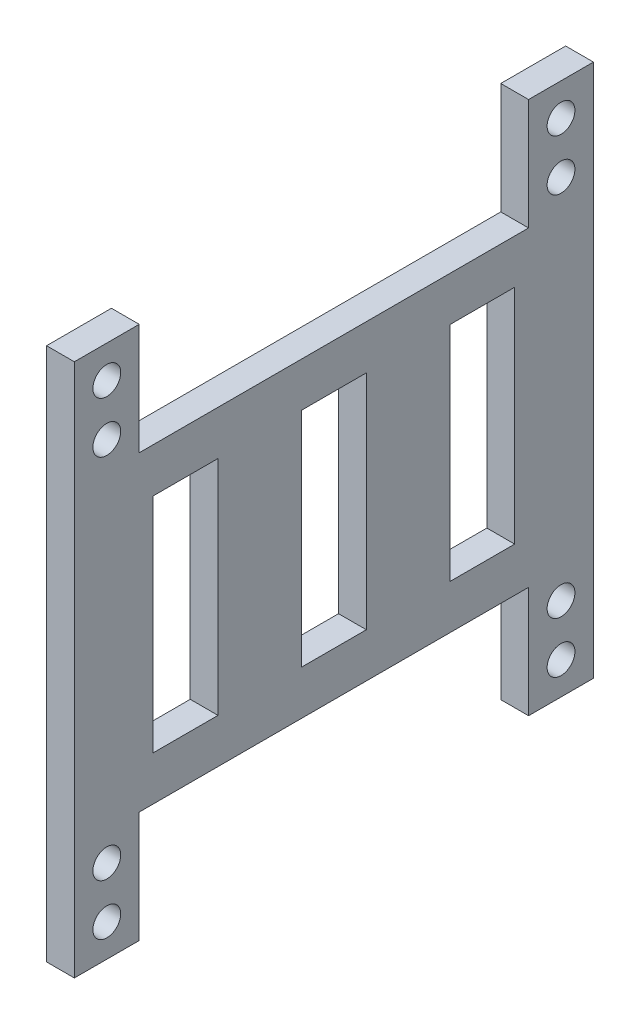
ISO-10303-21;
HEADER;
FILE_DESCRIPTION(('STEP AP214'),'2;1');
FILE_NAME('part.step','',(''),(''),'','','');
FILE_SCHEMA(('AUTOMOTIVE_DESIGN { 1 0 10303 214 1 1 1 1 }'));
ENDSEC;
DATA;
#1=APPLICATION_CONTEXT('core data for automotive mechanical design processes');
#2=APPLICATION_PROTOCOL_DEFINITION('international standard','automotive_design',2000,#1);
#3=PRODUCT_CONTEXT('',#1,'mechanical');
#4=PRODUCT('Part','Part','',(#3));
#5=PRODUCT_RELATED_PRODUCT_CATEGORY('part','',(#4));
#6=PRODUCT_DEFINITION_FORMATION('','',#4);
#7=PRODUCT_DEFINITION_CONTEXT('part definition',#1,'design');
#8=PRODUCT_DEFINITION('design','',#6,#7);
#9=PRODUCT_DEFINITION_SHAPE('','',#8);
#10=(LENGTH_UNIT() NAMED_UNIT(*) SI_UNIT(.MILLI.,.METRE.));
#11=(NAMED_UNIT(*) PLANE_ANGLE_UNIT() SI_UNIT($,.RADIAN.));
#12=(NAMED_UNIT(*) SI_UNIT($,.STERADIAN.) SOLID_ANGLE_UNIT());
#13=UNCERTAINTY_MEASURE_WITH_UNIT(LENGTH_MEASURE(1.E-05),#10,'distance_accuracy_value','');
#14=(GEOMETRIC_REPRESENTATION_CONTEXT(3) GLOBAL_UNCERTAINTY_ASSIGNED_CONTEXT((#13)) GLOBAL_UNIT_ASSIGNED_CONTEXT((#10,
#11,#12)) REPRESENTATION_CONTEXT('',''));
#15=CARTESIAN_POINT('',(0.,0.,0.));
#16=DIRECTION('',(0.,0.,1.));
#17=DIRECTION('',(1.,0.,0.));
#18=AXIS2_PLACEMENT_3D('',#15,#16,#17);
#19=CARTESIAN_POINT('',(3.,-28.785,0.));
#20=DIRECTION('',(0.,-1.,0.));
#21=DIRECTION('',(0.,0.,-1.));
#22=AXIS2_PLACEMENT_3D('',#19,#20,#21);
#23=PLANE('',#22);
#24=DIRECTION('',(0.,0.,1.));
#25=VECTOR('',#24,1.);
#26=CARTESIAN_POINT('',(0.,-28.785,0.));
#27=LINE('',#26,#25);
#28=CARTESIAN_POINT('',(0.,-28.785,-28.));
#29=VERTEX_POINT('',#28);
#30=CARTESIAN_POINT('',(0.,-28.785,-21.));
#31=VERTEX_POINT('',#30);
#32=EDGE_CURVE('E262',#29,#31,#27,.T.);
#33=ORIENTED_EDGE('',*,*,#32,.F.);
#34=DIRECTION('',(-1.,0.,0.));
#35=VECTOR('',#34,1.);
#36=CARTESIAN_POINT('',(3.,-28.785,-28.));
#37=LINE('',#36,#35);
#38=CARTESIAN_POINT('',(3.,-28.785,-28.));
#39=VERTEX_POINT('',#38);
#40=EDGE_CURVE('E404',#39,#29,#37,.T.);
#41=ORIENTED_EDGE('',*,*,#40,.F.);
#42=DIRECTION('',(0.,0.,1.));
#43=VECTOR('',#42,1.);
#44=CARTESIAN_POINT('',(3.,-28.785,0.));
#45=LINE('',#44,#43);
#46=CARTESIAN_POINT('',(3.,-28.785,-21.));
#47=VERTEX_POINT('',#46);
#48=EDGE_CURVE('E269',#39,#47,#45,.T.);
#49=ORIENTED_EDGE('',*,*,#48,.T.);
#50=DIRECTION('',(-1.,0.,0.));
#51=VECTOR('',#50,1.);
#52=CARTESIAN_POINT('',(3.,-28.785,-21.));
#53=LINE('',#52,#51);
#54=EDGE_CURVE('E324',#47,#31,#53,.T.);
#55=ORIENTED_EDGE('',*,*,#54,.T.);
#56=EDGE_LOOP('',(#33,#41,#49,#55));
#57=FACE_BOUND('',#56,.T.);
#58=ADVANCED_FACE('F37',(#57),#23,.T.);
#59=CARTESIAN_POINT('',(3.,0.,-28.));
#60=DIRECTION('',(0.,0.,1.));
#61=DIRECTION('',(1.,0.,0.));
#62=AXIS2_PLACEMENT_3D('',#59,#60,#61);
#63=PLANE('',#62);
#64=DIRECTION('',(0.,1.,0.));
#65=VECTOR('',#64,1.);
#66=CARTESIAN_POINT('',(0.,0.,-28.));
#67=LINE('',#66,#65);
#68=CARTESIAN_POINT('',(0.,28.785,-28.));
#69=VERTEX_POINT('',#68);
#70=EDGE_CURVE('E327',#29,#69,#67,.T.);
#71=ORIENTED_EDGE('',*,*,#70,.T.);
#72=DIRECTION('',(-1.,0.,0.));
#73=VECTOR('',#72,1.);
#74=CARTESIAN_POINT('',(3.,28.785,-28.));
#75=LINE('',#74,#73);
#76=CARTESIAN_POINT('',(3.,28.785,-28.));
#77=VERTEX_POINT('',#76);
#78=EDGE_CURVE('E401',#77,#69,#75,.T.);
#79=ORIENTED_EDGE('',*,*,#78,.F.);
#80=DIRECTION('',(0.,1.,0.));
#81=VECTOR('',#80,1.);
#82=CARTESIAN_POINT('',(3.,0.,-28.));
#83=LINE('',#82,#81);
#84=EDGE_CURVE('E272',#39,#77,#83,.T.);
#85=ORIENTED_EDGE('',*,*,#84,.F.);
#86=ORIENTED_EDGE('',*,*,#40,.T.);
#87=EDGE_LOOP('',(#71,#79,#85,#86));
#88=FACE_BOUND('',#87,.T.);
#89=ADVANCED_FACE('F461',(#88),#63,.F.);
#90=CARTESIAN_POINT('',(3.,28.785,0.));
#91=DIRECTION('',(0.,-1.,0.));
#92=DIRECTION('',(0.,0.,-1.));
#93=AXIS2_PLACEMENT_3D('',#90,#91,#92);
#94=PLANE('',#93);
#95=DIRECTION('',(0.,0.,1.));
#96=VECTOR('',#95,1.);
#97=CARTESIAN_POINT('',(0.,28.785,0.));
#98=LINE('',#97,#96);
#99=CARTESIAN_POINT('',(0.,28.785,-21.));
#100=VERTEX_POINT('',#99);
#101=EDGE_CURVE('E329',#69,#100,#98,.T.);
#102=ORIENTED_EDGE('',*,*,#101,.T.);
#103=DIRECTION('',(-1.,0.,0.));
#104=VECTOR('',#103,1.);
#105=CARTESIAN_POINT('',(3.,28.785,-21.));
#106=LINE('',#105,#104);
#107=CARTESIAN_POINT('',(3.,28.785,-21.));
#108=VERTEX_POINT('',#107);
#109=EDGE_CURVE('E399',#108,#100,#106,.T.);
#110=ORIENTED_EDGE('',*,*,#109,.F.);
#111=DIRECTION('',(0.,0.,1.));
#112=VECTOR('',#111,1.);
#113=CARTESIAN_POINT('',(3.,28.785,0.));
#114=LINE('',#113,#112);
#115=EDGE_CURVE('E275',#77,#108,#114,.T.);
#116=ORIENTED_EDGE('',*,*,#115,.F.);
#117=ORIENTED_EDGE('',*,*,#78,.T.);
#118=EDGE_LOOP('',(#102,#110,#116,#117));
#119=FACE_BOUND('',#118,.T.);
#120=ADVANCED_FACE('F466',(#119),#94,.F.);
#121=CARTESIAN_POINT('',(3.,0.,-21.));
#122=DIRECTION('',(0.,0.,1.));
#123=DIRECTION('',(0.,-1.,0.));
#124=AXIS2_PLACEMENT_3D('',#121,#122,#123);
#125=PLANE('',#124);
#126=DIRECTION('',(0.,1.,0.));
#127=VECTOR('',#126,1.);
#128=CARTESIAN_POINT('',(0.,0.,-21.));
#129=LINE('',#128,#127);
#130=CARTESIAN_POINT('',(0.,16.785,-21.));
#131=VERTEX_POINT('',#130);
#132=EDGE_CURVE('E332',#131,#100,#129,.T.);
#133=ORIENTED_EDGE('',*,*,#132,.F.);
#134=DIRECTION('',(-1.,0.,0.));
#135=VECTOR('',#134,1.);
#136=CARTESIAN_POINT('',(3.,16.785,-21.));
#137=LINE('',#136,#135);
#138=CARTESIAN_POINT('',(3.,16.785,-21.));
#139=VERTEX_POINT('',#138);
#140=EDGE_CURVE('E397',#139,#131,#137,.T.);
#141=ORIENTED_EDGE('',*,*,#140,.F.);
#142=DIRECTION('',(0.,1.,0.));
#143=VECTOR('',#142,1.);
#144=CARTESIAN_POINT('',(3.,0.,-21.));
#145=LINE('',#144,#143);
#146=EDGE_CURVE('E277',#139,#108,#145,.T.);
#147=ORIENTED_EDGE('',*,*,#146,.T.);
#148=ORIENTED_EDGE('',*,*,#109,.T.);
#149=EDGE_LOOP('',(#133,#141,#147,#148));
#150=FACE_BOUND('',#149,.T.);
#151=ADVANCED_FACE('F519',(#150),#125,.T.);
#152=CARTESIAN_POINT('',(3.,16.785,0.));
#153=DIRECTION('',(0.,1.,0.));
#154=DIRECTION('',(0.,0.,1.));
#155=AXIS2_PLACEMENT_3D('',#152,#153,#154);
#156=PLANE('',#155);
#157=DIRECTION('',(0.,0.,-1.));
#158=VECTOR('',#157,1.);
#159=CARTESIAN_POINT('',(0.,16.785,0.));
#160=LINE('',#159,#158);
#161=CARTESIAN_POINT('',(0.,16.785,21.));
#162=VERTEX_POINT('',#161);
#163=EDGE_CURVE('E335',#162,#131,#160,.T.);
#164=ORIENTED_EDGE('',*,*,#163,.F.);
#165=DIRECTION('',(-1.,0.,0.));
#166=VECTOR('',#165,1.);
#167=CARTESIAN_POINT('',(3.,16.785,21.));
#168=LINE('',#167,#166);
#169=CARTESIAN_POINT('',(3.,16.785,21.));
#170=VERTEX_POINT('',#169);
#171=EDGE_CURVE('E395',#170,#162,#168,.T.);
#172=ORIENTED_EDGE('',*,*,#171,.F.);
#173=DIRECTION('',(0.,0.,-1.));
#174=VECTOR('',#173,1.);
#175=CARTESIAN_POINT('',(3.,16.785,0.));
#176=LINE('',#175,#174);
#177=EDGE_CURVE('E280',#170,#139,#176,.T.);
#178=ORIENTED_EDGE('',*,*,#177,.T.);
#179=ORIENTED_EDGE('',*,*,#140,.T.);
#180=EDGE_LOOP('',(#164,#172,#178,#179));
#181=FACE_BOUND('',#180,.T.);
#182=ADVANCED_FACE('F515',(#181),#156,.T.);
#183=CARTESIAN_POINT('',(3.,0.,21.));
#184=DIRECTION('',(0.,0.,1.));
#185=DIRECTION('',(1.,0.,0.));
#186=AXIS2_PLACEMENT_3D('',#183,#184,#185);
#187=PLANE('',#186);
#188=DIRECTION('',(0.,1.,0.));
#189=VECTOR('',#188,1.);
#190=CARTESIAN_POINT('',(0.,0.,21.));
#191=LINE('',#190,#189);
#192=CARTESIAN_POINT('',(0.,28.785,21.));
#193=VERTEX_POINT('',#192);
#194=EDGE_CURVE('E338',#162,#193,#191,.T.);
#195=ORIENTED_EDGE('',*,*,#194,.T.);
#196=DIRECTION('',(-1.,0.,0.));
#197=VECTOR('',#196,1.);
#198=CARTESIAN_POINT('',(3.,28.785,21.));
#199=LINE('',#198,#197);
#200=CARTESIAN_POINT('',(3.,28.785,21.));
#201=VERTEX_POINT('',#200);
#202=EDGE_CURVE('E393',#201,#193,#199,.T.);
#203=ORIENTED_EDGE('',*,*,#202,.F.);
#204=DIRECTION('',(0.,1.,0.));
#205=VECTOR('',#204,1.);
#206=CARTESIAN_POINT('',(3.,0.,21.));
#207=LINE('',#206,#205);
#208=EDGE_CURVE('E283',#170,#201,#207,.T.);
#209=ORIENTED_EDGE('',*,*,#208,.F.);
#210=ORIENTED_EDGE('',*,*,#171,.T.);
#211=EDGE_LOOP('',(#195,#203,#209,#210));
#212=FACE_BOUND('',#211,.T.);
#213=ADVANCED_FACE('F526',(#212),#187,.F.);
#214=CARTESIAN_POINT('',(3.,28.785,0.));
#215=DIRECTION('',(0.,1.,0.));
#216=DIRECTION('',(0.,0.,1.));
#217=AXIS2_PLACEMENT_3D('',#214,#215,#216);
#218=PLANE('',#217);
#219=DIRECTION('',(0.,0.,-1.));
#220=VECTOR('',#219,1.);
#221=CARTESIAN_POINT('',(0.,28.785,0.));
#222=LINE('',#221,#220);
#223=CARTESIAN_POINT('',(0.,28.785,28.));
#224=VERTEX_POINT('',#223);
#225=EDGE_CURVE('E341',#224,#193,#222,.T.);
#226=ORIENTED_EDGE('',*,*,#225,.F.);
#227=DIRECTION('',(-1.,0.,0.));
#228=VECTOR('',#227,1.);
#229=CARTESIAN_POINT('',(3.,28.785,28.));
#230=LINE('',#229,#228);
#231=CARTESIAN_POINT('',(3.,28.785,28.));
#232=VERTEX_POINT('',#231);
#233=EDGE_CURVE('E391',#232,#224,#230,.T.);
#234=ORIENTED_EDGE('',*,*,#233,.F.);
#235=DIRECTION('',(0.,0.,-1.));
#236=VECTOR('',#235,1.);
#237=CARTESIAN_POINT('',(3.,28.785,0.));
#238=LINE('',#237,#236);
#239=EDGE_CURVE('E285',#232,#201,#238,.T.);
#240=ORIENTED_EDGE('',*,*,#239,.T.);
#241=ORIENTED_EDGE('',*,*,#202,.T.);
#242=EDGE_LOOP('',(#226,#234,#240,#241));
#243=FACE_BOUND('',#242,.T.);
#244=ADVANCED_FACE('F509',(#243),#218,.T.);
#245=CARTESIAN_POINT('',(3.,0.,28.));
#246=DIRECTION('',(0.,0.,1.));
#247=DIRECTION('',(0.,-1.,0.));
#248=AXIS2_PLACEMENT_3D('',#245,#246,#247);
#249=PLANE('',#248);
#250=DIRECTION('',(0.,1.,0.));
#251=VECTOR('',#250,1.);
#252=CARTESIAN_POINT('',(0.,0.,28.));
#253=LINE('',#252,#251);
#254=CARTESIAN_POINT('',(0.,-28.785,28.));
#255=VERTEX_POINT('',#254);
#256=EDGE_CURVE('E344',#255,#224,#253,.T.);
#257=ORIENTED_EDGE('',*,*,#256,.F.);
#258=DIRECTION('',(-1.,0.,0.));
#259=VECTOR('',#258,1.);
#260=CARTESIAN_POINT('',(3.,-28.785,28.));
#261=LINE('',#260,#259);
#262=CARTESIAN_POINT('',(3.,-28.785,28.));
#263=VERTEX_POINT('',#262);
#264=EDGE_CURVE('E389',#263,#255,#261,.T.);
#265=ORIENTED_EDGE('',*,*,#264,.F.);
#266=DIRECTION('',(0.,1.,0.));
#267=VECTOR('',#266,1.);
#268=CARTESIAN_POINT('',(3.,0.,28.));
#269=LINE('',#268,#267);
#270=EDGE_CURVE('E288',#263,#232,#269,.T.);
#271=ORIENTED_EDGE('',*,*,#270,.T.);
#272=ORIENTED_EDGE('',*,*,#233,.T.);
#273=EDGE_LOOP('',(#257,#265,#271,#272));
#274=FACE_BOUND('',#273,.T.);
#275=ADVANCED_FACE('F504',(#274),#249,.T.);
#276=CARTESIAN_POINT('',(3.,-28.785,0.));
#277=DIRECTION('',(0.,1.,0.));
#278=DIRECTION('',(0.,0.,1.));
#279=AXIS2_PLACEMENT_3D('',#276,#277,#278);
#280=PLANE('',#279);
#281=DIRECTION('',(0.,0.,-1.));
#282=VECTOR('',#281,1.);
#283=CARTESIAN_POINT('',(0.,-28.785,0.));
#284=LINE('',#283,#282);
#285=CARTESIAN_POINT('',(0.,-28.785,21.));
#286=VERTEX_POINT('',#285);
#287=EDGE_CURVE('E347',#255,#286,#284,.T.);
#288=ORIENTED_EDGE('',*,*,#287,.T.);
#289=DIRECTION('',(-1.,0.,0.));
#290=VECTOR('',#289,1.);
#291=CARTESIAN_POINT('',(3.,-28.785,21.));
#292=LINE('',#291,#290);
#293=CARTESIAN_POINT('',(3.,-28.785,21.));
#294=VERTEX_POINT('',#293);
#295=EDGE_CURVE('E387',#294,#286,#292,.T.);
#296=ORIENTED_EDGE('',*,*,#295,.F.);
#297=DIRECTION('',(0.,0.,-1.));
#298=VECTOR('',#297,1.);
#299=CARTESIAN_POINT('',(3.,-28.785,0.));
#300=LINE('',#299,#298);
#301=EDGE_CURVE('E291',#263,#294,#300,.T.);
#302=ORIENTED_EDGE('',*,*,#301,.F.);
#303=ORIENTED_EDGE('',*,*,#264,.T.);
#304=EDGE_LOOP('',(#288,#296,#302,#303));
#305=FACE_BOUND('',#304,.T.);
#306=ADVANCED_FACE('F501',(#305),#280,.F.);
#307=CARTESIAN_POINT('',(3.,0.,21.));
#308=DIRECTION('',(0.,0.,-1.));
#309=DIRECTION('',(-1.,0.,0.));
#310=AXIS2_PLACEMENT_3D('',#307,#308,#309);
#311=PLANE('',#310);
#312=DIRECTION('',(0.,-1.,0.));
#313=VECTOR('',#312,1.);
#314=CARTESIAN_POINT('',(0.,0.,21.));
#315=LINE('',#314,#313);
#316=CARTESIAN_POINT('',(0.,-16.785,21.));
#317=VERTEX_POINT('',#316);
#318=EDGE_CURVE('E350',#317,#286,#315,.T.);
#319=ORIENTED_EDGE('',*,*,#318,.F.);
#320=DIRECTION('',(-1.,0.,0.));
#321=VECTOR('',#320,1.);
#322=CARTESIAN_POINT('',(3.,-16.785,21.));
#323=LINE('',#322,#321);
#324=CARTESIAN_POINT('',(3.,-16.785,21.));
#325=VERTEX_POINT('',#324);
#326=EDGE_CURVE('E385',#325,#317,#323,.T.);
#327=ORIENTED_EDGE('',*,*,#326,.F.);
#328=DIRECTION('',(0.,-1.,0.));
#329=VECTOR('',#328,1.);
#330=CARTESIAN_POINT('',(3.,0.,21.));
#331=LINE('',#330,#329);
#332=EDGE_CURVE('E293',#325,#294,#331,.T.);
#333=ORIENTED_EDGE('',*,*,#332,.T.);
#334=ORIENTED_EDGE('',*,*,#295,.T.);
#335=EDGE_LOOP('',(#319,#327,#333,#334));
#336=FACE_BOUND('',#335,.T.);
#337=ADVANCED_FACE('F497',(#336),#311,.T.);
#338=CARTESIAN_POINT('',(3.,-16.785,0.));
#339=DIRECTION('',(0.,1.,0.));
#340=DIRECTION('',(0.,0.,1.));
#341=AXIS2_PLACEMENT_3D('',#338,#339,#340);
#342=PLANE('',#341);
#343=DIRECTION('',(0.,0.,-1.));
#344=VECTOR('',#343,1.);
#345=CARTESIAN_POINT('',(0.,-16.785,0.));
#346=LINE('',#345,#344);
#347=CARTESIAN_POINT('',(0.,-16.785,-21.));
#348=VERTEX_POINT('',#347);
#349=EDGE_CURVE('E353',#317,#348,#346,.T.);
#350=ORIENTED_EDGE('',*,*,#349,.T.);
#351=DIRECTION('',(-1.,0.,0.));
#352=VECTOR('',#351,1.);
#353=CARTESIAN_POINT('',(3.,-16.785,-21.));
#354=LINE('',#353,#352);
#355=CARTESIAN_POINT('',(3.,-16.785,-21.));
#356=VERTEX_POINT('',#355);
#357=EDGE_CURVE('E382',#356,#348,#354,.T.);
#358=ORIENTED_EDGE('',*,*,#357,.F.);
#359=DIRECTION('',(0.,0.,-1.));
#360=VECTOR('',#359,1.);
#361=CARTESIAN_POINT('',(3.,-16.785,0.));
#362=LINE('',#361,#360);
#363=EDGE_CURVE('E296',#325,#356,#362,.T.);
#364=ORIENTED_EDGE('',*,*,#363,.F.);
#365=ORIENTED_EDGE('',*,*,#326,.T.);
#366=EDGE_LOOP('',(#350,#358,#364,#365));
#367=FACE_BOUND('',#366,.T.);
#368=ADVANCED_FACE('F493',(#367),#342,.F.);
#369=CARTESIAN_POINT('',(3.,-25.285,-24.5));
#370=DIRECTION('',(-1.,0.,0.));
#371=DIRECTION('',(0.,0.,1.));
#372=AXIS2_PLACEMENT_3D('',#369,#370,#371);
#373=CYLINDRICAL_SURFACE('',#372,1.5);
#374=CARTESIAN_POINT('',(3.,-25.285,-24.5));
#375=DIRECTION('',(1.,0.,0.));
#376=DIRECTION('',(0.,0.,-1.));
#377=AXIS2_PLACEMENT_3D('',#374,#375,#376);
#378=CIRCLE('',#377,1.5);
#379=CARTESIAN_POINT('',(3.,-25.285,-26.));
#380=VERTEX_POINT('',#379);
#381=EDGE_CURVE('E318',#380,#380,#378,.T.);
#382=ORIENTED_EDGE('',*,*,#381,.T.);
#383=EDGE_LOOP('',(#382));
#384=FACE_BOUND('',#383,.T.);
#385=CARTESIAN_POINT('',(0.,-25.285,-24.5));
#386=DIRECTION('',(1.,0.,0.));
#387=DIRECTION('',(0.,0.,-1.));
#388=AXIS2_PLACEMENT_3D('',#385,#386,#387);
#389=CIRCLE('',#388,1.5);
#390=CARTESIAN_POINT('',(0.,-25.285,-26.));
#391=VERTEX_POINT('',#390);
#392=EDGE_CURVE('E376',#391,#391,#389,.T.);
#393=ORIENTED_EDGE('',*,*,#392,.F.);
#394=EDGE_LOOP('',(#393));
#395=FACE_BOUND('',#394,.T.);
#396=ADVANCED_FACE('F542',(#384,#395),#373,.F.);
#397=CARTESIAN_POINT('',(3.,25.285,-24.5));
#398=DIRECTION('',(-1.,0.,0.));
#399=DIRECTION('',(0.,0.,1.));
#400=AXIS2_PLACEMENT_3D('',#397,#398,#399);
#401=CYLINDRICAL_SURFACE('',#400,1.5);
#402=CARTESIAN_POINT('',(3.,25.285,-24.5));
#403=DIRECTION('',(1.,0.,0.));
#404=DIRECTION('',(0.,0.,-1.));
#405=AXIS2_PLACEMENT_3D('',#402,#403,#404);
#406=CIRCLE('',#405,1.5);
#407=CARTESIAN_POINT('',(3.,25.285,-26.));
#408=VERTEX_POINT('',#407);
#409=EDGE_CURVE('E315',#408,#408,#406,.F.);
#410=ORIENTED_EDGE('',*,*,#409,.F.);
#411=EDGE_LOOP('',(#410));
#412=FACE_BOUND('',#411,.T.);
#413=CARTESIAN_POINT('',(0.,25.285,-24.5));
#414=DIRECTION('',(1.,0.,0.));
#415=DIRECTION('',(0.,0.,-1.));
#416=AXIS2_PLACEMENT_3D('',#413,#414,#415);
#417=CIRCLE('',#416,1.5);
#418=CARTESIAN_POINT('',(0.,25.285,-26.));
#419=VERTEX_POINT('',#418);
#420=EDGE_CURVE('E373',#419,#419,#417,.F.);
#421=ORIENTED_EDGE('',*,*,#420,.T.);
#422=EDGE_LOOP('',(#421));
#423=FACE_BOUND('',#422,.T.);
#424=ADVANCED_FACE('F565',(#412,#423),#401,.F.);
#425=CARTESIAN_POINT('',(3.,19.785,-24.5));
#426=DIRECTION('',(-1.,0.,0.));
#427=DIRECTION('',(0.,0.,1.));
#428=AXIS2_PLACEMENT_3D('',#425,#426,#427);
#429=CYLINDRICAL_SURFACE('',#428,1.5);
#430=CARTESIAN_POINT('',(3.,19.785,-24.5));
#431=DIRECTION('',(1.,0.,0.));
#432=DIRECTION('',(0.,0.,-1.));
#433=AXIS2_PLACEMENT_3D('',#430,#431,#432);
#434=CIRCLE('',#433,1.5);
#435=CARTESIAN_POINT('',(3.,19.785,-26.));
#436=VERTEX_POINT('',#435);
#437=EDGE_CURVE('E312',#436,#436,#434,.F.);
#438=ORIENTED_EDGE('',*,*,#437,.F.);
#439=EDGE_LOOP('',(#438));
#440=FACE_BOUND('',#439,.T.);
#441=CARTESIAN_POINT('',(0.,19.785,-24.5));
#442=DIRECTION('',(1.,0.,0.));
#443=DIRECTION('',(0.,0.,-1.));
#444=AXIS2_PLACEMENT_3D('',#441,#442,#443);
#445=CIRCLE('',#444,1.5);
#446=CARTESIAN_POINT('',(0.,19.785,-26.));
#447=VERTEX_POINT('',#446);
#448=EDGE_CURVE('E370',#447,#447,#445,.F.);
#449=ORIENTED_EDGE('',*,*,#448,.T.);
#450=EDGE_LOOP('',(#449));
#451=FACE_BOUND('',#450,.T.);
#452=ADVANCED_FACE('F561',(#440,#451),#429,.F.);
#453=CARTESIAN_POINT('',(3.,-25.285,24.5));
#454=DIRECTION('',(-1.,0.,0.));
#455=DIRECTION('',(0.,0.,1.));
#456=AXIS2_PLACEMENT_3D('',#453,#454,#455);
#457=CYLINDRICAL_SURFACE('',#456,1.5);
#458=CARTESIAN_POINT('',(3.,-25.285,24.5));
#459=DIRECTION('',(1.,0.,0.));
#460=DIRECTION('',(0.,0.,-1.));
#461=AXIS2_PLACEMENT_3D('',#458,#459,#460);
#462=CIRCLE('',#461,1.5);
#463=CARTESIAN_POINT('',(3.,-25.285,23.));
#464=VERTEX_POINT('',#463);
#465=EDGE_CURVE('E309',#464,#464,#462,.F.);
#466=ORIENTED_EDGE('',*,*,#465,.F.);
#467=EDGE_LOOP('',(#466));
#468=FACE_BOUND('',#467,.T.);
#469=CARTESIAN_POINT('',(0.,-25.285,24.5));
#470=DIRECTION('',(1.,0.,0.));
#471=DIRECTION('',(0.,0.,-1.));
#472=AXIS2_PLACEMENT_3D('',#469,#470,#471);
#473=CIRCLE('',#472,1.5);
#474=CARTESIAN_POINT('',(0.,-25.285,23.));
#475=VERTEX_POINT('',#474);
#476=EDGE_CURVE('E367',#475,#475,#473,.F.);
#477=ORIENTED_EDGE('',*,*,#476,.T.);
#478=EDGE_LOOP('',(#477));
#479=FACE_BOUND('',#478,.T.);
#480=ADVANCED_FACE('F557',(#468,#479),#457,.F.);
#481=CARTESIAN_POINT('',(3.,-19.785,24.5));
#482=DIRECTION('',(-1.,0.,0.));
#483=DIRECTION('',(0.,0.,1.));
#484=AXIS2_PLACEMENT_3D('',#481,#482,#483);
#485=CYLINDRICAL_SURFACE('',#484,1.5);
#486=CARTESIAN_POINT('',(3.,-19.785,24.5));
#487=DIRECTION('',(1.,0.,0.));
#488=DIRECTION('',(0.,0.,-1.));
#489=AXIS2_PLACEMENT_3D('',#486,#487,#488);
#490=CIRCLE('',#489,1.5);
#491=CARTESIAN_POINT('',(3.,-19.785,23.));
#492=VERTEX_POINT('',#491);
#493=EDGE_CURVE('E306',#492,#492,#490,.F.);
#494=ORIENTED_EDGE('',*,*,#493,.F.);
#495=EDGE_LOOP('',(#494));
#496=FACE_BOUND('',#495,.T.);
#497=CARTESIAN_POINT('',(0.,-19.785,24.5));
#498=DIRECTION('',(1.,0.,0.));
#499=DIRECTION('',(0.,0.,-1.));
#500=AXIS2_PLACEMENT_3D('',#497,#498,#499);
#501=CIRCLE('',#500,1.5);
#502=CARTESIAN_POINT('',(0.,-19.785,23.));
#503=VERTEX_POINT('',#502);
#504=EDGE_CURVE('E364',#503,#503,#501,.F.);
#505=ORIENTED_EDGE('',*,*,#504,.T.);
#506=EDGE_LOOP('',(#505));
#507=FACE_BOUND('',#506,.T.);
#508=ADVANCED_FACE('F553',(#496,#507),#485,.F.);
#509=CARTESIAN_POINT('',(3.,25.285,24.5));
#510=DIRECTION('',(-1.,0.,0.));
#511=DIRECTION('',(0.,0.,1.));
#512=AXIS2_PLACEMENT_3D('',#509,#510,#511);
#513=CYLINDRICAL_SURFACE('',#512,1.5);
#514=CARTESIAN_POINT('',(3.,25.285,24.5));
#515=DIRECTION('',(1.,0.,0.));
#516=DIRECTION('',(0.,0.,-1.));
#517=AXIS2_PLACEMENT_3D('',#514,#515,#516);
#518=CIRCLE('',#517,1.5);
#519=CARTESIAN_POINT('',(3.,25.285,23.));
#520=VERTEX_POINT('',#519);
#521=EDGE_CURVE('E303',#520,#520,#518,.T.);
#522=ORIENTED_EDGE('',*,*,#521,.T.);
#523=EDGE_LOOP('',(#522));
#524=FACE_BOUND('',#523,.T.);
#525=CARTESIAN_POINT('',(0.,25.285,24.5));
#526=DIRECTION('',(1.,0.,0.));
#527=DIRECTION('',(0.,0.,-1.));
#528=AXIS2_PLACEMENT_3D('',#525,#526,#527);
#529=CIRCLE('',#528,1.5);
#530=CARTESIAN_POINT('',(0.,25.285,23.));
#531=VERTEX_POINT('',#530);
#532=EDGE_CURVE('E361',#531,#531,#529,.T.);
#533=ORIENTED_EDGE('',*,*,#532,.F.);
#534=EDGE_LOOP('',(#533));
#535=FACE_BOUND('',#534,.T.);
#536=ADVANCED_FACE('F549',(#524,#535),#513,.F.);
#537=CARTESIAN_POINT('',(3.,19.785,24.5));
#538=DIRECTION('',(-1.,0.,0.));
#539=DIRECTION('',(0.,0.,1.));
#540=AXIS2_PLACEMENT_3D('',#537,#538,#539);
#541=CYLINDRICAL_SURFACE('',#540,1.5);
#542=CARTESIAN_POINT('',(3.,19.785,24.5));
#543=DIRECTION('',(1.,0.,0.));
#544=DIRECTION('',(0.,0.,-1.));
#545=AXIS2_PLACEMENT_3D('',#542,#543,#544);
#546=CIRCLE('',#545,1.5);
#547=CARTESIAN_POINT('',(3.,19.785,23.));
#548=VERTEX_POINT('',#547);
#549=EDGE_CURVE('E300',#548,#548,#546,.T.);
#550=ORIENTED_EDGE('',*,*,#549,.T.);
#551=EDGE_LOOP('',(#550));
#552=FACE_BOUND('',#551,.T.);
#553=CARTESIAN_POINT('',(0.,19.785,24.5));
#554=DIRECTION('',(1.,0.,0.));
#555=DIRECTION('',(0.,0.,-1.));
#556=AXIS2_PLACEMENT_3D('',#553,#554,#555);
#557=CIRCLE('',#556,1.5);
#558=CARTESIAN_POINT('',(0.,19.785,23.));
#559=VERTEX_POINT('',#558);
#560=EDGE_CURVE('E358',#559,#559,#557,.T.);
#561=ORIENTED_EDGE('',*,*,#560,.F.);
#562=EDGE_LOOP('',(#561));
#563=FACE_BOUND('',#562,.T.);
#564=ADVANCED_FACE('F546',(#552,#563),#541,.F.);
#565=CARTESIAN_POINT('',(3.,0.,-21.));
#566=DIRECTION('',(0.,0.,-1.));
#567=DIRECTION('',(-1.,0.,0.));
#568=AXIS2_PLACEMENT_3D('',#565,#566,#567);
#569=PLANE('',#568);
#570=DIRECTION('',(0.,-1.,0.));
#571=VECTOR('',#570,1.);
#572=CARTESIAN_POINT('',(0.,0.,-21.));
#573=LINE('',#572,#571);
#574=EDGE_CURVE('E355',#348,#31,#573,.T.);
#575=ORIENTED_EDGE('',*,*,#574,.T.);
#576=ORIENTED_EDGE('',*,*,#54,.F.);
#577=DIRECTION('',(0.,-1.,0.));
#578=VECTOR('',#577,1.);
#579=CARTESIAN_POINT('',(3.,0.,-21.));
#580=LINE('',#579,#578);
#581=EDGE_CURVE('E298',#356,#47,#580,.T.);
#582=ORIENTED_EDGE('',*,*,#581,.F.);
#583=ORIENTED_EDGE('',*,*,#357,.T.);
#584=EDGE_LOOP('',(#575,#576,#582,#583));
#585=FACE_BOUND('',#584,.T.);
#586=ADVANCED_FACE('F491',(#585),#569,.F.);
#587=CARTESIAN_POINT('',(3.,-19.785,-24.5));
#588=DIRECTION('',(-1.,0.,0.));
#589=DIRECTION('',(0.,0.,1.));
#590=AXIS2_PLACEMENT_3D('',#587,#588,#589);
#591=CYLINDRICAL_SURFACE('',#590,1.5);
#592=CARTESIAN_POINT('',(3.,-19.785,-24.5));
#593=DIRECTION('',(1.,0.,0.));
#594=DIRECTION('',(0.,0.,-1.));
#595=AXIS2_PLACEMENT_3D('',#592,#593,#594);
#596=CIRCLE('',#595,1.5);
#597=CARTESIAN_POINT('',(3.,-19.785,-26.));
#598=VERTEX_POINT('',#597);
#599=EDGE_CURVE('E321',#598,#598,#596,.T.);
#600=ORIENTED_EDGE('',*,*,#599,.T.);
#601=EDGE_LOOP('',(#600));
#602=FACE_BOUND('',#601,.T.);
#603=CARTESIAN_POINT('',(0.,-19.785,-24.5));
#604=DIRECTION('',(1.,0.,0.));
#605=DIRECTION('',(0.,0.,-1.));
#606=AXIS2_PLACEMENT_3D('',#603,#604,#605);
#607=CIRCLE('',#606,1.5);
#608=CARTESIAN_POINT('',(0.,-19.785,-26.));
#609=VERTEX_POINT('',#608);
#610=EDGE_CURVE('E273',#609,#609,#607,.T.);
#611=ORIENTED_EDGE('',*,*,#610,.F.);
#612=EDGE_LOOP('',(#611));
#613=FACE_BOUND('',#612,.T.);
#614=ADVANCED_FACE('F545',(#602,#613),#591,.F.);
#615=CARTESIAN_POINT('',(3.,0.,0.));
#616=DIRECTION('',(1.,0.,0.));
#617=DIRECTION('',(0.,0.,-1.));
#618=AXIS2_PLACEMENT_3D('',#615,#616,#617);
#619=PLANE('',#618);
#620=DIRECTION('',(0.,1.,0.));
#621=VECTOR('',#620,1.);
#622=CARTESIAN_POINT('',(3.,-12.,-19.5));
#623=LINE('',#622,#621);
#624=CARTESIAN_POINT('',(3.,-12.,-19.5));
#625=VERTEX_POINT('',#624);
#626=CARTESIAN_POINT('',(3.,12.,-19.5));
#627=VERTEX_POINT('',#626);
#628=EDGE_CURVE('E51',#625,#627,#623,.T.);
#629=ORIENTED_EDGE('',*,*,#628,.F.);
#630=DIRECTION('',(0.,0.,-1.));
#631=VECTOR('',#630,1.);
#632=CARTESIAN_POINT('',(3.,-12.,-12.5));
#633=LINE('',#632,#631);
#634=CARTESIAN_POINT('',(3.,-12.,-12.5));
#635=VERTEX_POINT('',#634);
#636=EDGE_CURVE('E238',#635,#625,#633,.T.);
#637=ORIENTED_EDGE('',*,*,#636,.F.);
#638=DIRECTION('',(0.,-1.,0.));
#639=VECTOR('',#638,1.);
#640=CARTESIAN_POINT('',(3.,-12.,-12.5));
#641=LINE('',#640,#639);
#642=CARTESIAN_POINT('',(3.,12.,-12.5));
#643=VERTEX_POINT('',#642);
#644=EDGE_CURVE('E235',#643,#635,#641,.T.);
#645=ORIENTED_EDGE('',*,*,#644,.F.);
#646=DIRECTION('',(0.,0.,1.));
#647=VECTOR('',#646,1.);
#648=CARTESIAN_POINT('',(3.,12.,-12.5));
#649=LINE('',#648,#647);
#650=EDGE_CURVE('E232',#627,#643,#649,.T.);
#651=ORIENTED_EDGE('',*,*,#650,.F.);
#652=EDGE_LOOP('',(#629,#637,#645,#651));
#653=FACE_BOUND('',#652,.T.);
#654=DIRECTION('',(0.,1.,0.));
#655=VECTOR('',#654,1.);
#656=CARTESIAN_POINT('',(3.,-12.,12.5));
#657=LINE('',#656,#655);
#658=CARTESIAN_POINT('',(3.,-12.,12.5));
#659=VERTEX_POINT('',#658);
#660=CARTESIAN_POINT('',(3.,12.,12.5));
#661=VERTEX_POINT('',#660);
#662=EDGE_CURVE('E59',#659,#661,#657,.T.);
#663=ORIENTED_EDGE('',*,*,#662,.F.);
#664=DIRECTION('',(0.,0.,-1.));
#665=VECTOR('',#664,1.);
#666=CARTESIAN_POINT('',(3.,-12.,19.5));
#667=LINE('',#666,#665);
#668=CARTESIAN_POINT('',(3.,-12.,19.5));
#669=VERTEX_POINT('',#668);
#670=EDGE_CURVE('E221',#669,#659,#667,.T.);
#671=ORIENTED_EDGE('',*,*,#670,.F.);
#672=DIRECTION('',(0.,-1.,0.));
#673=VECTOR('',#672,1.);
#674=CARTESIAN_POINT('',(3.,-12.,19.5));
#675=LINE('',#674,#673);
#676=CARTESIAN_POINT('',(3.,12.,19.5));
#677=VERTEX_POINT('',#676);
#678=EDGE_CURVE('E204',#677,#669,#675,.T.);
#679=ORIENTED_EDGE('',*,*,#678,.F.);
#680=DIRECTION('',(0.,0.,1.));
#681=VECTOR('',#680,1.);
#682=CARTESIAN_POINT('',(3.,12.,19.5));
#683=LINE('',#682,#681);
#684=EDGE_CURVE('E214',#661,#677,#683,.T.);
#685=ORIENTED_EDGE('',*,*,#684,.F.);
#686=EDGE_LOOP('',(#663,#671,#679,#685));
#687=FACE_BOUND('',#686,.T.);
#688=DIRECTION('',(0.,1.,0.));
#689=VECTOR('',#688,1.);
#690=CARTESIAN_POINT('',(3.,-12.,-3.5));
#691=LINE('',#690,#689);
#692=CARTESIAN_POINT('',(3.,-12.,-3.5));
#693=VERTEX_POINT('',#692);
#694=CARTESIAN_POINT('',(3.,12.,-3.5));
#695=VERTEX_POINT('',#694);
#696=EDGE_CURVE('E228',#693,#695,#691,.T.);
#697=ORIENTED_EDGE('',*,*,#696,.F.);
#698=DIRECTION('',(0.,0.,-1.));
#699=VECTOR('',#698,1.);
#700=CARTESIAN_POINT('',(3.,-12.,3.5));
#701=LINE('',#700,#699);
#702=CARTESIAN_POINT('',(3.,-12.,3.5));
#703=VERTEX_POINT('',#702);
#704=EDGE_CURVE('E256',#703,#693,#701,.T.);
#705=ORIENTED_EDGE('',*,*,#704,.F.);
#706=DIRECTION('',(0.,-1.,0.));
#707=VECTOR('',#706,1.);
#708=CARTESIAN_POINT('',(3.,-12.,3.5));
#709=LINE('',#708,#707);
#710=CARTESIAN_POINT('',(3.,12.,3.5));
#711=VERTEX_POINT('',#710);
#712=EDGE_CURVE('E253',#711,#703,#709,.T.);
#713=ORIENTED_EDGE('',*,*,#712,.F.);
#714=DIRECTION('',(0.,0.,1.));
#715=VECTOR('',#714,1.);
#716=CARTESIAN_POINT('',(3.,12.,3.5));
#717=LINE('',#716,#715);
#718=EDGE_CURVE('E250',#695,#711,#717,.T.);
#719=ORIENTED_EDGE('',*,*,#718,.F.);
#720=EDGE_LOOP('',(#697,#705,#713,#719));
#721=FACE_BOUND('',#720,.T.);
#722=ORIENTED_EDGE('',*,*,#48,.F.);
#723=ORIENTED_EDGE('',*,*,#84,.T.);
#724=ORIENTED_EDGE('',*,*,#115,.T.);
#725=ORIENTED_EDGE('',*,*,#146,.F.);
#726=ORIENTED_EDGE('',*,*,#177,.F.);
#727=ORIENTED_EDGE('',*,*,#208,.T.);
#728=ORIENTED_EDGE('',*,*,#239,.F.);
#729=ORIENTED_EDGE('',*,*,#270,.F.);
#730=ORIENTED_EDGE('',*,*,#301,.T.);
#731=ORIENTED_EDGE('',*,*,#332,.F.);
#732=ORIENTED_EDGE('',*,*,#363,.T.);
#733=ORIENTED_EDGE('',*,*,#581,.T.);
#734=EDGE_LOOP('',(#722,#723,#724,#725,#726,#727,#728,#729,#730,#731,#732,#733));
#735=FACE_BOUND('',#734,.T.);
#736=ORIENTED_EDGE('',*,*,#549,.F.);
#737=EDGE_LOOP('',(#736));
#738=FACE_BOUND('',#737,.T.);
#739=ORIENTED_EDGE('',*,*,#521,.F.);
#740=EDGE_LOOP('',(#739));
#741=FACE_BOUND('',#740,.T.);
#742=ORIENTED_EDGE('',*,*,#493,.T.);
#743=EDGE_LOOP('',(#742));
#744=FACE_BOUND('',#743,.T.);
#745=ORIENTED_EDGE('',*,*,#465,.T.);
#746=EDGE_LOOP('',(#745));
#747=FACE_BOUND('',#746,.T.);
#748=ORIENTED_EDGE('',*,*,#437,.T.);
#749=EDGE_LOOP('',(#748));
#750=FACE_BOUND('',#749,.T.);
#751=ORIENTED_EDGE('',*,*,#409,.T.);
#752=EDGE_LOOP('',(#751));
#753=FACE_BOUND('',#752,.T.);
#754=ORIENTED_EDGE('',*,*,#381,.F.);
#755=EDGE_LOOP('',(#754));
#756=FACE_BOUND('',#755,.T.);
#757=ORIENTED_EDGE('',*,*,#599,.F.);
#758=EDGE_LOOP('',(#757));
#759=FACE_BOUND('',#758,.T.);
#760=ADVANCED_FACE('F218',(#653,#687,#721,#735,#738,#741,#744,#747,#750,#753,#756,#759),#619,.T.);
#761=CARTESIAN_POINT('',(0.,0.,0.));
#762=DIRECTION('',(1.,0.,0.));
#763=DIRECTION('',(0.,0.,-1.));
#764=AXIS2_PLACEMENT_3D('',#761,#762,#763);
#765=PLANE('',#764);
#766=DIRECTION('',(0.,0.,-1.));
#767=VECTOR('',#766,1.);
#768=CARTESIAN_POINT('',(0.,-12.,0.));
#769=LINE('',#768,#767);
#770=CARTESIAN_POINT('',(0.,-12.,-12.5));
#771=VERTEX_POINT('',#770);
#772=CARTESIAN_POINT('',(0.,-12.,-19.5));
#773=VERTEX_POINT('',#772);
#774=EDGE_CURVE('E44',#771,#773,#769,.T.);
#775=ORIENTED_EDGE('',*,*,#774,.T.);
#776=DIRECTION('',(0.,1.,0.));
#777=VECTOR('',#776,1.);
#778=CARTESIAN_POINT('',(0.,0.,-19.5));
#779=LINE('',#778,#777);
#780=CARTESIAN_POINT('',(0.,12.,-19.5));
#781=VERTEX_POINT('',#780);
#782=EDGE_CURVE('E11',#773,#781,#779,.T.);
#783=ORIENTED_EDGE('',*,*,#782,.T.);
#784=DIRECTION('',(0.,0.,1.));
#785=VECTOR('',#784,1.);
#786=CARTESIAN_POINT('',(0.,12.,0.));
#787=LINE('',#786,#785);
#788=CARTESIAN_POINT('',(0.,12.,-12.5));
#789=VERTEX_POINT('',#788);
#790=EDGE_CURVE('E427',#781,#789,#787,.T.);
#791=ORIENTED_EDGE('',*,*,#790,.T.);
#792=DIRECTION('',(0.,-1.,0.));
#793=VECTOR('',#792,1.);
#794=CARTESIAN_POINT('',(0.,0.,-12.5));
#795=LINE('',#794,#793);
#796=EDGE_CURVE('E430',#789,#771,#795,.T.);
#797=ORIENTED_EDGE('',*,*,#796,.T.);
#798=EDGE_LOOP('',(#775,#783,#791,#797));
#799=FACE_BOUND('',#798,.T.);
#800=DIRECTION('',(0.,0.,-1.));
#801=VECTOR('',#800,1.);
#802=CARTESIAN_POINT('',(0.,-12.,0.));
#803=LINE('',#802,#801);
#804=CARTESIAN_POINT('',(0.,-12.,19.5));
#805=VERTEX_POINT('',#804);
#806=CARTESIAN_POINT('',(0.,-12.,12.5));
#807=VERTEX_POINT('',#806);
#808=EDGE_CURVE('E421',#805,#807,#803,.T.);
#809=ORIENTED_EDGE('',*,*,#808,.T.);
#810=DIRECTION('',(0.,1.,0.));
#811=VECTOR('',#810,1.);
#812=CARTESIAN_POINT('',(0.,0.,12.5));
#813=LINE('',#812,#811);
#814=CARTESIAN_POINT('',(0.,12.,12.5));
#815=VERTEX_POINT('',#814);
#816=EDGE_CURVE('E424',#807,#815,#813,.T.);
#817=ORIENTED_EDGE('',*,*,#816,.T.);
#818=DIRECTION('',(0.,0.,1.));
#819=VECTOR('',#818,1.);
#820=CARTESIAN_POINT('',(0.,12.,0.));
#821=LINE('',#820,#819);
#822=CARTESIAN_POINT('',(0.,12.,19.5));
#823=VERTEX_POINT('',#822);
#824=EDGE_CURVE('E418',#815,#823,#821,.T.);
#825=ORIENTED_EDGE('',*,*,#824,.T.);
#826=DIRECTION('',(0.,-1.,0.));
#827=VECTOR('',#826,1.);
#828=CARTESIAN_POINT('',(0.,0.,19.5));
#829=LINE('',#828,#827);
#830=EDGE_CURVE('E207',#823,#805,#829,.T.);
#831=ORIENTED_EDGE('',*,*,#830,.T.);
#832=EDGE_LOOP('',(#809,#817,#825,#831));
#833=FACE_BOUND('',#832,.T.);
#834=DIRECTION('',(0.,0.,-1.));
#835=VECTOR('',#834,1.);
#836=CARTESIAN_POINT('',(0.,-12.,0.));
#837=LINE('',#836,#835);
#838=CARTESIAN_POINT('',(0.,-12.,3.5));
#839=VERTEX_POINT('',#838);
#840=CARTESIAN_POINT('',(0.,-12.,-3.5));
#841=VERTEX_POINT('',#840);
#842=EDGE_CURVE('E412',#839,#841,#837,.T.);
#843=ORIENTED_EDGE('',*,*,#842,.T.);
#844=DIRECTION('',(0.,1.,0.));
#845=VECTOR('',#844,1.);
#846=CARTESIAN_POINT('',(0.,0.,-3.5));
#847=LINE('',#846,#845);
#848=CARTESIAN_POINT('',(0.,12.,-3.5));
#849=VERTEX_POINT('',#848);
#850=EDGE_CURVE('E415',#841,#849,#847,.T.);
#851=ORIENTED_EDGE('',*,*,#850,.T.);
#852=DIRECTION('',(0.,0.,1.));
#853=VECTOR('',#852,1.);
#854=CARTESIAN_POINT('',(0.,12.,0.));
#855=LINE('',#854,#853);
#856=CARTESIAN_POINT('',(0.,12.,3.5));
#857=VERTEX_POINT('',#856);
#858=EDGE_CURVE('E406',#849,#857,#855,.T.);
#859=ORIENTED_EDGE('',*,*,#858,.T.);
#860=DIRECTION('',(0.,-1.,0.));
#861=VECTOR('',#860,1.);
#862=CARTESIAN_POINT('',(0.,0.,3.5));
#863=LINE('',#862,#861);
#864=EDGE_CURVE('E409',#857,#839,#863,.T.);
#865=ORIENTED_EDGE('',*,*,#864,.T.);
#866=EDGE_LOOP('',(#843,#851,#859,#865));
#867=FACE_BOUND('',#866,.T.);
#868=ORIENTED_EDGE('',*,*,#32,.T.);
#869=ORIENTED_EDGE('',*,*,#574,.F.);
#870=ORIENTED_EDGE('',*,*,#349,.F.);
#871=ORIENTED_EDGE('',*,*,#318,.T.);
#872=ORIENTED_EDGE('',*,*,#287,.F.);
#873=ORIENTED_EDGE('',*,*,#256,.T.);
#874=ORIENTED_EDGE('',*,*,#225,.T.);
#875=ORIENTED_EDGE('',*,*,#194,.F.);
#876=ORIENTED_EDGE('',*,*,#163,.T.);
#877=ORIENTED_EDGE('',*,*,#132,.T.);
#878=ORIENTED_EDGE('',*,*,#101,.F.);
#879=ORIENTED_EDGE('',*,*,#70,.F.);
#880=EDGE_LOOP('',(#868,#869,#870,#871,#872,#873,#874,#875,#876,#877,#878,#879));
#881=FACE_BOUND('',#880,.T.);
#882=ORIENTED_EDGE('',*,*,#560,.T.);
#883=EDGE_LOOP('',(#882));
#884=FACE_BOUND('',#883,.T.);
#885=ORIENTED_EDGE('',*,*,#532,.T.);
#886=EDGE_LOOP('',(#885));
#887=FACE_BOUND('',#886,.T.);
#888=ORIENTED_EDGE('',*,*,#504,.F.);
#889=EDGE_LOOP('',(#888));
#890=FACE_BOUND('',#889,.T.);
#891=ORIENTED_EDGE('',*,*,#476,.F.);
#892=EDGE_LOOP('',(#891));
#893=FACE_BOUND('',#892,.T.);
#894=ORIENTED_EDGE('',*,*,#448,.F.);
#895=EDGE_LOOP('',(#894));
#896=FACE_BOUND('',#895,.T.);
#897=ORIENTED_EDGE('',*,*,#420,.F.);
#898=EDGE_LOOP('',(#897));
#899=FACE_BOUND('',#898,.T.);
#900=ORIENTED_EDGE('',*,*,#392,.T.);
#901=EDGE_LOOP('',(#900));
#902=FACE_BOUND('',#901,.T.);
#903=ORIENTED_EDGE('',*,*,#610,.T.);
#904=EDGE_LOOP('',(#903));
#905=FACE_BOUND('',#904,.T.);
#906=ADVANCED_FACE('F434',(#799,#833,#867,#881,#884,#887,#890,#893,#896,#899,#902,#905),#765,.F.);
#907=CARTESIAN_POINT('',(-7.,-12.,-3.5));
#908=DIRECTION('',(0.,0.,-1.));
#909=DIRECTION('',(-1.,0.,0.));
#910=AXIS2_PLACEMENT_3D('',#907,#908,#909);
#911=PLANE('',#910);
#912=DIRECTION('',(1.,0.,0.));
#913=VECTOR('',#912,1.);
#914=CARTESIAN_POINT('',(-7.,-12.,-3.5));
#915=LINE('',#914,#913);
#916=EDGE_CURVE('E260',#841,#693,#915,.T.);
#917=ORIENTED_EDGE('',*,*,#916,.T.);
#918=ORIENTED_EDGE('',*,*,#696,.T.);
#919=DIRECTION('',(1.,0.,0.));
#920=VECTOR('',#919,1.);
#921=CARTESIAN_POINT('',(-7.,12.,-3.5));
#922=LINE('',#921,#920);
#923=EDGE_CURVE('E259',#849,#695,#922,.T.);
#924=ORIENTED_EDGE('',*,*,#923,.F.);
#925=ORIENTED_EDGE('',*,*,#850,.F.);
#926=EDGE_LOOP('',(#917,#918,#924,#925));
#927=FACE_BOUND('',#926,.T.);
#928=ADVANCED_FACE('F578',(#927),#911,.F.);
#929=CARTESIAN_POINT('',(-7.,-12.,3.5));
#930=DIRECTION('',(0.,-1.,0.));
#931=DIRECTION('',(0.,0.,-1.));
#932=AXIS2_PLACEMENT_3D('',#929,#930,#931);
#933=PLANE('',#932);
#934=DIRECTION('',(1.,0.,0.));
#935=VECTOR('',#934,1.);
#936=CARTESIAN_POINT('',(-7.,-12.,3.5));
#937=LINE('',#936,#935);
#938=EDGE_CURVE('E263',#839,#703,#937,.T.);
#939=ORIENTED_EDGE('',*,*,#938,.T.);
#940=ORIENTED_EDGE('',*,*,#704,.T.);
#941=ORIENTED_EDGE('',*,*,#916,.F.);
#942=ORIENTED_EDGE('',*,*,#842,.F.);
#943=EDGE_LOOP('',(#939,#940,#941,#942));
#944=FACE_BOUND('',#943,.T.);
#945=ADVANCED_FACE('F583',(#944),#933,.F.);
#946=CARTESIAN_POINT('',(-7.,-12.,3.5));
#947=DIRECTION('',(0.,0.,1.));
#948=DIRECTION('',(1.,0.,0.));
#949=AXIS2_PLACEMENT_3D('',#946,#947,#948);
#950=PLANE('',#949);
#951=DIRECTION('',(1.,0.,0.));
#952=VECTOR('',#951,1.);
#953=CARTESIAN_POINT('',(-7.,12.,3.5));
#954=LINE('',#953,#952);
#955=EDGE_CURVE('E265',#857,#711,#954,.T.);
#956=ORIENTED_EDGE('',*,*,#955,.T.);
#957=ORIENTED_EDGE('',*,*,#712,.T.);
#958=ORIENTED_EDGE('',*,*,#938,.F.);
#959=ORIENTED_EDGE('',*,*,#864,.F.);
#960=EDGE_LOOP('',(#956,#957,#958,#959));
#961=FACE_BOUND('',#960,.T.);
#962=ADVANCED_FACE('F589',(#961),#950,.F.);
#963=CARTESIAN_POINT('',(-7.,12.,3.5));
#964=DIRECTION('',(0.,1.,0.));
#965=DIRECTION('',(0.,0.,1.));
#966=AXIS2_PLACEMENT_3D('',#963,#964,#965);
#967=PLANE('',#966);
#968=ORIENTED_EDGE('',*,*,#923,.T.);
#969=ORIENTED_EDGE('',*,*,#718,.T.);
#970=ORIENTED_EDGE('',*,*,#955,.F.);
#971=ORIENTED_EDGE('',*,*,#858,.F.);
#972=EDGE_LOOP('',(#968,#969,#970,#971));
#973=FACE_BOUND('',#972,.T.);
#974=ADVANCED_FACE('F585',(#973),#967,.F.);
#975=CARTESIAN_POINT('',(-7.,-12.,12.5));
#976=DIRECTION('',(0.,0.,-1.));
#977=DIRECTION('',(-1.,0.,0.));
#978=AXIS2_PLACEMENT_3D('',#975,#976,#977);
#979=PLANE('',#978);
#980=DIRECTION('',(1.,0.,0.));
#981=VECTOR('',#980,1.);
#982=CARTESIAN_POINT('',(-7.,-12.,12.5));
#983=LINE('',#982,#981);
#984=EDGE_CURVE('E226',#807,#659,#983,.T.);
#985=ORIENTED_EDGE('',*,*,#984,.T.);
#986=ORIENTED_EDGE('',*,*,#662,.T.);
#987=DIRECTION('',(1.,0.,0.));
#988=VECTOR('',#987,1.);
#989=CARTESIAN_POINT('',(-7.,12.,12.5));
#990=LINE('',#989,#988);
#991=EDGE_CURVE('E211',#815,#661,#990,.T.);
#992=ORIENTED_EDGE('',*,*,#991,.F.);
#993=ORIENTED_EDGE('',*,*,#816,.F.);
#994=EDGE_LOOP('',(#985,#986,#992,#993));
#995=FACE_BOUND('',#994,.T.);
#996=ADVANCED_FACE('F588',(#995),#979,.F.);
#997=CARTESIAN_POINT('',(-7.,-12.,19.5));
#998=DIRECTION('',(0.,-1.,0.));
#999=DIRECTION('',(0.,0.,-1.));
#1000=AXIS2_PLACEMENT_3D('',#997,#998,#999);
#1001=PLANE('',#1000);
#1002=DIRECTION('',(1.,0.,0.));
#1003=VECTOR('',#1002,1.);
#1004=CARTESIAN_POINT('',(-7.,-12.,19.5));
#1005=LINE('',#1004,#1003);
#1006=EDGE_CURVE('E210',#805,#669,#1005,.T.);
#1007=ORIENTED_EDGE('',*,*,#1006,.T.);
#1008=ORIENTED_EDGE('',*,*,#670,.T.);
#1009=ORIENTED_EDGE('',*,*,#984,.F.);
#1010=ORIENTED_EDGE('',*,*,#808,.F.);
#1011=EDGE_LOOP('',(#1007,#1008,#1009,#1010));
#1012=FACE_BOUND('',#1011,.T.);
#1013=ADVANCED_FACE('F622',(#1012),#1001,.F.);
#1014=CARTESIAN_POINT('',(-7.,-12.,19.5));
#1015=DIRECTION('',(0.,0.,1.));
#1016=DIRECTION('',(1.,0.,0.));
#1017=AXIS2_PLACEMENT_3D('',#1014,#1015,#1016);
#1018=PLANE('',#1017);
#1019=DIRECTION('',(1.,0.,0.));
#1020=VECTOR('',#1019,1.);
#1021=CARTESIAN_POINT('',(-7.,12.,19.5));
#1022=LINE('',#1021,#1020);
#1023=EDGE_CURVE('E199',#823,#677,#1022,.T.);
#1024=ORIENTED_EDGE('',*,*,#1023,.T.);
#1025=ORIENTED_EDGE('',*,*,#678,.T.);
#1026=ORIENTED_EDGE('',*,*,#1006,.F.);
#1027=ORIENTED_EDGE('',*,*,#830,.F.);
#1028=EDGE_LOOP('',(#1024,#1025,#1026,#1027));
#1029=FACE_BOUND('',#1028,.T.);
#1030=ADVANCED_FACE('F201',(#1029),#1018,.F.);
#1031=CARTESIAN_POINT('',(-7.,12.,19.5));
#1032=DIRECTION('',(0.,1.,0.));
#1033=DIRECTION('',(0.,0.,1.));
#1034=AXIS2_PLACEMENT_3D('',#1031,#1032,#1033);
#1035=PLANE('',#1034);
#1036=ORIENTED_EDGE('',*,*,#991,.T.);
#1037=ORIENTED_EDGE('',*,*,#684,.T.);
#1038=ORIENTED_EDGE('',*,*,#1023,.F.);
#1039=ORIENTED_EDGE('',*,*,#824,.F.);
#1040=EDGE_LOOP('',(#1036,#1037,#1038,#1039));
#1041=FACE_BOUND('',#1040,.T.);
#1042=ADVANCED_FACE('F215',(#1041),#1035,.F.);
#1043=CARTESIAN_POINT('',(-7.,-12.,-19.5));
#1044=DIRECTION('',(0.,0.,-1.));
#1045=DIRECTION('',(-1.,0.,0.));
#1046=AXIS2_PLACEMENT_3D('',#1043,#1044,#1045);
#1047=PLANE('',#1046);
#1048=DIRECTION('',(1.,0.,0.));
#1049=VECTOR('',#1048,1.);
#1050=CARTESIAN_POINT('',(-7.,-12.,-19.5));
#1051=LINE('',#1050,#1049);
#1052=EDGE_CURVE('E242',#773,#625,#1051,.T.);
#1053=ORIENTED_EDGE('',*,*,#1052,.T.);
#1054=ORIENTED_EDGE('',*,*,#628,.T.);
#1055=DIRECTION('',(1.,0.,0.));
#1056=VECTOR('',#1055,1.);
#1057=CARTESIAN_POINT('',(-7.,12.,-19.5));
#1058=LINE('',#1057,#1056);
#1059=EDGE_CURVE('E241',#781,#627,#1058,.T.);
#1060=ORIENTED_EDGE('',*,*,#1059,.F.);
#1061=ORIENTED_EDGE('',*,*,#782,.F.);
#1062=EDGE_LOOP('',(#1053,#1054,#1060,#1061));
#1063=FACE_BOUND('',#1062,.T.);
#1064=ADVANCED_FACE('F449',(#1063),#1047,.F.);
#1065=CARTESIAN_POINT('',(-7.,-12.,-12.5));
#1066=DIRECTION('',(0.,-1.,0.));
#1067=DIRECTION('',(0.,0.,-1.));
#1068=AXIS2_PLACEMENT_3D('',#1065,#1066,#1067);
#1069=PLANE('',#1068);
#1070=DIRECTION('',(1.,0.,0.));
#1071=VECTOR('',#1070,1.);
#1072=CARTESIAN_POINT('',(-7.,-12.,-12.5));
#1073=LINE('',#1072,#1071);
#1074=EDGE_CURVE('E244',#771,#635,#1073,.T.);
#1075=ORIENTED_EDGE('',*,*,#1074,.T.);
#1076=ORIENTED_EDGE('',*,*,#636,.T.);
#1077=ORIENTED_EDGE('',*,*,#1052,.F.);
#1078=ORIENTED_EDGE('',*,*,#774,.F.);
#1079=EDGE_LOOP('',(#1075,#1076,#1077,#1078));
#1080=FACE_BOUND('',#1079,.T.);
#1081=ADVANCED_FACE('F440',(#1080),#1069,.F.);
#1082=CARTESIAN_POINT('',(-7.,-12.,-12.5));
#1083=DIRECTION('',(0.,0.,1.));
#1084=DIRECTION('',(1.,0.,0.));
#1085=AXIS2_PLACEMENT_3D('',#1082,#1083,#1084);
#1086=PLANE('',#1085);
#1087=DIRECTION('',(1.,0.,0.));
#1088=VECTOR('',#1087,1.);
#1089=CARTESIAN_POINT('',(-7.,12.,-12.5));
#1090=LINE('',#1089,#1088);
#1091=EDGE_CURVE('E246',#789,#643,#1090,.T.);
#1092=ORIENTED_EDGE('',*,*,#1091,.T.);
#1093=ORIENTED_EDGE('',*,*,#644,.T.);
#1094=ORIENTED_EDGE('',*,*,#1074,.F.);
#1095=ORIENTED_EDGE('',*,*,#796,.F.);
#1096=EDGE_LOOP('',(#1092,#1093,#1094,#1095));
#1097=FACE_BOUND('',#1096,.T.);
#1098=ADVANCED_FACE('F442',(#1097),#1086,.F.);
#1099=CARTESIAN_POINT('',(-7.,12.,-12.5));
#1100=DIRECTION('',(0.,1.,0.));
#1101=DIRECTION('',(0.,0.,1.));
#1102=AXIS2_PLACEMENT_3D('',#1099,#1100,#1101);
#1103=PLANE('',#1102);
#1104=ORIENTED_EDGE('',*,*,#1059,.T.);
#1105=ORIENTED_EDGE('',*,*,#650,.T.);
#1106=ORIENTED_EDGE('',*,*,#1091,.F.);
#1107=ORIENTED_EDGE('',*,*,#790,.F.);
#1108=EDGE_LOOP('',(#1104,#1105,#1106,#1107));
#1109=FACE_BOUND('',#1108,.T.);
#1110=ADVANCED_FACE('F448',(#1109),#1103,.F.);
#1111=CLOSED_SHELL('',(#58,#89,#120,#151,#182,#213,#244,#275,#306,#337,#368,#396,#424,#452,#480,
#508,#536,#564,#586,#614,#760,#906,#928,#945,#962,#974,#996,#1013,#1030,#1042,#1064,#1081,#1098,#1110));
#1112=MANIFOLD_SOLID_BREP('B2',#1111);
#1113=ADVANCED_BREP_SHAPE_REPRESENTATION('',(#18,#1112),#14);
#1114=SHAPE_DEFINITION_REPRESENTATION(#9,#1113);
ENDSEC;
END-ISO-10303-21;
